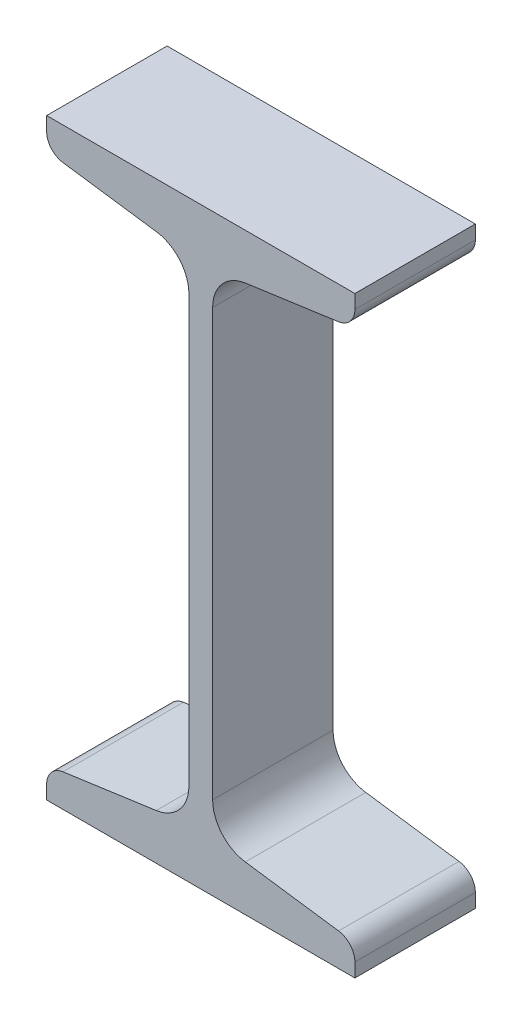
ISO-10303-21;
HEADER;
FILE_DESCRIPTION(('STEP AP214'),'2;1');
FILE_NAME('part.step','',(''),(''),'','','');
FILE_SCHEMA(('AUTOMOTIVE_DESIGN { 1 0 10303 214 1 1 1 1 }'));
ENDSEC;
DATA;
#1=APPLICATION_CONTEXT('core data for automotive mechanical design processes');
#2=APPLICATION_PROTOCOL_DEFINITION('international standard','automotive_design',2000,#1);
#3=PRODUCT_CONTEXT('',#1,'mechanical');
#4=PRODUCT('Part','Part','',(#3));
#5=PRODUCT_RELATED_PRODUCT_CATEGORY('part','',(#4));
#6=PRODUCT_DEFINITION_FORMATION('','',#4);
#7=PRODUCT_DEFINITION_CONTEXT('part definition',#1,'design');
#8=PRODUCT_DEFINITION('design','',#6,#7);
#9=PRODUCT_DEFINITION_SHAPE('','',#8);
#10=(LENGTH_UNIT() NAMED_UNIT(*) SI_UNIT(.MILLI.,.METRE.));
#11=(NAMED_UNIT(*) PLANE_ANGLE_UNIT() SI_UNIT($,.RADIAN.));
#12=(NAMED_UNIT(*) SI_UNIT($,.STERADIAN.) SOLID_ANGLE_UNIT());
#13=UNCERTAINTY_MEASURE_WITH_UNIT(LENGTH_MEASURE(1.E-05),#10,'distance_accuracy_value','');
#14=(GEOMETRIC_REPRESENTATION_CONTEXT(3) GLOBAL_UNCERTAINTY_ASSIGNED_CONTEXT((#13)) GLOBAL_UNIT_ASSIGNED_CONTEXT((#10,
#11,#12)) REPRESENTATION_CONTEXT('',''));
#15=CARTESIAN_POINT('',(0.,0.,0.));
#16=DIRECTION('',(0.,0.,1.));
#17=DIRECTION('',(1.,0.,0.));
#18=AXIS2_PLACEMENT_3D('',#15,#16,#17);
#19=CARTESIAN_POINT('',(-32.5,62.5,12.7));
#20=DIRECTION('',(1.,0.,0.));
#21=DIRECTION('',(0.,0.,-1.));
#22=AXIS2_PLACEMENT_3D('',#19,#20,#21);
#23=PLANE('',#22);
#24=DIRECTION('',(0.,-1.,0.));
#25=VECTOR('',#24,1.);
#26=CARTESIAN_POINT('',(-32.5,62.5,-12.7));
#27=LINE('',#26,#25);
#28=CARTESIAN_POINT('',(-32.5,62.5,-12.7));
#29=VERTEX_POINT('',#28);
#30=CARTESIAN_POINT('',(-32.5,59.5852594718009,-12.7));
#31=VERTEX_POINT('',#30);
#32=EDGE_CURVE('E201',#29,#31,#27,.T.);
#33=ORIENTED_EDGE('',*,*,#32,.T.);
#34=DIRECTION('',(0.,0.,-1.));
#35=VECTOR('',#34,1.);
#36=CARTESIAN_POINT('',(-32.5,59.5852594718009,12.7));
#37=LINE('',#36,#35);
#38=CARTESIAN_POINT('',(-32.5,59.5852594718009,12.7));
#39=VERTEX_POINT('',#38);
#40=EDGE_CURVE('E11',#39,#31,#37,.T.);
#41=ORIENTED_EDGE('',*,*,#40,.F.);
#42=DIRECTION('',(0.,-1.,0.));
#43=VECTOR('',#42,1.);
#44=CARTESIAN_POINT('',(-32.5,62.5,12.7));
#45=LINE('',#44,#43);
#46=CARTESIAN_POINT('',(-32.5,62.5,12.7));
#47=VERTEX_POINT('',#46);
#48=EDGE_CURVE('E239',#47,#39,#45,.T.);
#49=ORIENTED_EDGE('',*,*,#48,.F.);
#50=DIRECTION('',(0.,0.,-1.));
#51=VECTOR('',#50,1.);
#52=CARTESIAN_POINT('',(-32.5,62.5,12.7));
#53=LINE('',#52,#51);
#54=EDGE_CURVE('E197',#47,#29,#53,.T.);
#55=ORIENTED_EDGE('',*,*,#54,.T.);
#56=EDGE_LOOP('',(#33,#41,#49,#55));
#57=FACE_BOUND('',#56,.T.);
#58=ADVANCED_FACE('F33',(#57),#23,.F.);
#59=CARTESIAN_POINT('',(-28.5,59.5852594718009,12.7));
#60=DIRECTION('',(0.,0.,-1.));
#61=DIRECTION('',(-1.,0.,0.));
#62=AXIS2_PLACEMENT_3D('',#59,#60,#61);
#63=CYLINDRICAL_SURFACE('',#62,4.);
#64=CARTESIAN_POINT('',(-28.5,59.5852594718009,-12.7));
#65=DIRECTION('',(0.,0.,1.));
#66=DIRECTION('',(1.,0.,0.));
#67=AXIS2_PLACEMENT_3D('',#64,#65,#66);
#68=CIRCLE('',#67,4.);
#69=CARTESIAN_POINT('',(-29.0566924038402,55.6241871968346,-12.7));
#70=VERTEX_POINT('',#69);
#71=EDGE_CURVE('E204',#31,#70,#68,.T.);
#72=ORIENTED_EDGE('',*,*,#71,.T.);
#73=DIRECTION('',(0.,0.,-1.));
#74=VECTOR('',#73,1.);
#75=CARTESIAN_POINT('',(-29.0566924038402,55.6241871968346,12.7));
#76=LINE('',#75,#74);
#77=CARTESIAN_POINT('',(-29.0566924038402,55.6241871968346,12.7));
#78=VERTEX_POINT('',#77);
#79=EDGE_CURVE('E41',#78,#70,#76,.T.);
#80=ORIENTED_EDGE('',*,*,#79,.F.);
#81=CARTESIAN_POINT('',(-28.5,59.5852594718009,12.7));
#82=DIRECTION('',(0.,0.,1.));
#83=DIRECTION('',(1.,0.,0.));
#84=AXIS2_PLACEMENT_3D('',#81,#82,#83);
#85=CIRCLE('',#84,4.);
#86=EDGE_CURVE('E128',#39,#78,#85,.T.);
#87=ORIENTED_EDGE('',*,*,#86,.F.);
#88=ORIENTED_EDGE('',*,*,#40,.T.);
#89=EDGE_LOOP('',(#72,#80,#87,#88));
#90=FACE_BOUND('',#89,.T.);
#91=ADVANCED_FACE('F357',(#90),#63,.T.);
#92=CARTESIAN_POINT('',(-29.0566924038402,55.6241871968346,12.7));
#93=DIRECTION('',(0.13917310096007,0.99026806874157,0.));
#94=DIRECTION('',(-0.99026806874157,0.13917310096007,0.));
#95=AXIS2_PLACEMENT_3D('',#92,#93,#94);
#96=PLANE('',#95);
#97=DIRECTION('',(0.99026806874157,-0.13917310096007,0.));
#98=VECTOR('',#97,1.);
#99=CARTESIAN_POINT('',(-29.0566924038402,55.6241871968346,-12.7));
#100=LINE('',#99,#98);
#101=CARTESIAN_POINT('',(-9.38661519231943,52.8597381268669,-12.7));
#102=VERTEX_POINT('',#101);
#103=EDGE_CURVE('E206',#70,#102,#100,.T.);
#104=ORIENTED_EDGE('',*,*,#103,.T.);
#105=DIRECTION('',(0.,0.,-1.));
#106=VECTOR('',#105,1.);
#107=CARTESIAN_POINT('',(-9.38661519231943,52.8597381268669,12.7));
#108=LINE('',#107,#106);
#109=CARTESIAN_POINT('',(-9.38661519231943,52.8597381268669,12.7));
#110=VERTEX_POINT('',#109);
#111=EDGE_CURVE('E282',#110,#102,#108,.T.);
#112=ORIENTED_EDGE('',*,*,#111,.F.);
#113=DIRECTION('',(0.99026806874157,-0.13917310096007,0.));
#114=VECTOR('',#113,1.);
#115=CARTESIAN_POINT('',(-29.0566924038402,55.6241871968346,12.7));
#116=LINE('',#115,#114);
#117=EDGE_CURVE('E290',#78,#110,#116,.T.);
#118=ORIENTED_EDGE('',*,*,#117,.F.);
#119=ORIENTED_EDGE('',*,*,#79,.T.);
#120=EDGE_LOOP('',(#104,#112,#118,#119));
#121=FACE_BOUND('',#120,.T.);
#122=ADVANCED_FACE('F288',(#121),#96,.F.);
#123=CARTESIAN_POINT('',(-10.5,44.9375935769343,12.7));
#124=DIRECTION('',(0.,0.,-1.));
#125=DIRECTION('',(-1.,0.,0.));
#126=AXIS2_PLACEMENT_3D('',#123,#124,#125);
#127=CYLINDRICAL_SURFACE('',#126,7.99999999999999);
#128=CARTESIAN_POINT('',(-10.5,44.9375935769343,-12.7));
#129=DIRECTION('',(0.,0.,-1.));
#130=DIRECTION('',(-1.,0.,0.));
#131=AXIS2_PLACEMENT_3D('',#128,#129,#130);
#132=CIRCLE('',#131,7.99999999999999);
#133=CARTESIAN_POINT('',(-2.49999999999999,44.9375935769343,-12.7));
#134=VERTEX_POINT('',#133);
#135=EDGE_CURVE('E208',#102,#134,#132,.T.);
#136=ORIENTED_EDGE('',*,*,#135,.T.);
#137=DIRECTION('',(0.,0.,-1.));
#138=VECTOR('',#137,1.);
#139=CARTESIAN_POINT('',(-2.49999999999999,44.9375935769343,12.7));
#140=LINE('',#139,#138);
#141=CARTESIAN_POINT('',(-2.49999999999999,44.9375935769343,12.7));
#142=VERTEX_POINT('',#141);
#143=EDGE_CURVE('E279',#142,#134,#140,.T.);
#144=ORIENTED_EDGE('',*,*,#143,.F.);
#145=CARTESIAN_POINT('',(-10.5,44.9375935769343,12.7));
#146=DIRECTION('',(0.,0.,-1.));
#147=DIRECTION('',(-1.,0.,0.));
#148=AXIS2_PLACEMENT_3D('',#145,#146,#147);
#149=CIRCLE('',#148,7.99999999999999);
#150=EDGE_CURVE('E308',#110,#142,#149,.T.);
#151=ORIENTED_EDGE('',*,*,#150,.F.);
#152=ORIENTED_EDGE('',*,*,#111,.T.);
#153=EDGE_LOOP('',(#136,#144,#151,#152));
#154=FACE_BOUND('',#153,.T.);
#155=ADVANCED_FACE('F299',(#154),#127,.F.);
#156=CARTESIAN_POINT('',(-2.49999999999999,44.9375935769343,12.7));
#157=DIRECTION('',(1.,0.,0.));
#158=DIRECTION('',(0.,0.,-1.));
#159=AXIS2_PLACEMENT_3D('',#156,#157,#158);
#160=PLANE('',#159);
#161=DIRECTION('',(0.,-1.,0.));
#162=VECTOR('',#161,1.);
#163=CARTESIAN_POINT('',(-2.49999999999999,44.9375935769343,-12.7));
#164=LINE('',#163,#162);
#165=CARTESIAN_POINT('',(-2.49999999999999,-44.9375935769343,-12.7));
#166=VERTEX_POINT('',#165);
#167=EDGE_CURVE('E210',#134,#166,#164,.T.);
#168=ORIENTED_EDGE('',*,*,#167,.T.);
#169=DIRECTION('',(0.,0.,-1.));
#170=VECTOR('',#169,1.);
#171=CARTESIAN_POINT('',(-2.49999999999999,-44.9375935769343,12.7));
#172=LINE('',#171,#170);
#173=CARTESIAN_POINT('',(-2.49999999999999,-44.9375935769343,12.7));
#174=VERTEX_POINT('',#173);
#175=EDGE_CURVE('E276',#174,#166,#172,.T.);
#176=ORIENTED_EDGE('',*,*,#175,.F.);
#177=DIRECTION('',(0.,-1.,0.));
#178=VECTOR('',#177,1.);
#179=CARTESIAN_POINT('',(-2.49999999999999,44.9375935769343,12.7));
#180=LINE('',#179,#178);
#181=EDGE_CURVE('E305',#142,#174,#180,.T.);
#182=ORIENTED_EDGE('',*,*,#181,.F.);
#183=ORIENTED_EDGE('',*,*,#143,.T.);
#184=EDGE_LOOP('',(#168,#176,#182,#183));
#185=FACE_BOUND('',#184,.T.);
#186=ADVANCED_FACE('F303',(#185),#160,.F.);
#187=CARTESIAN_POINT('',(-10.5,-44.9375935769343,12.7));
#188=DIRECTION('',(0.,0.,-1.));
#189=DIRECTION('',(-1.,0.,0.));
#190=AXIS2_PLACEMENT_3D('',#187,#188,#189);
#191=CYLINDRICAL_SURFACE('',#190,7.99999999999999);
#192=CARTESIAN_POINT('',(-10.5,-44.9375935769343,-12.7));
#193=DIRECTION('',(0.,0.,-1.));
#194=DIRECTION('',(1.,0.,0.));
#195=AXIS2_PLACEMENT_3D('',#192,#193,#194);
#196=CIRCLE('',#195,7.99999999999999);
#197=CARTESIAN_POINT('',(-9.38661519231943,-52.8597381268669,-12.7));
#198=VERTEX_POINT('',#197);
#199=EDGE_CURVE('E212',#166,#198,#196,.T.);
#200=ORIENTED_EDGE('',*,*,#199,.T.);
#201=DIRECTION('',(0.,0.,-1.));
#202=VECTOR('',#201,1.);
#203=CARTESIAN_POINT('',(-9.38661519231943,-52.8597381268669,12.7));
#204=LINE('',#203,#202);
#205=CARTESIAN_POINT('',(-9.38661519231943,-52.8597381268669,12.7));
#206=VERTEX_POINT('',#205);
#207=EDGE_CURVE('E273',#206,#198,#204,.T.);
#208=ORIENTED_EDGE('',*,*,#207,.F.);
#209=CARTESIAN_POINT('',(-10.5,-44.9375935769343,12.7));
#210=DIRECTION('',(0.,0.,-1.));
#211=DIRECTION('',(1.,0.,0.));
#212=AXIS2_PLACEMENT_3D('',#209,#210,#211);
#213=CIRCLE('',#212,7.99999999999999);
#214=EDGE_CURVE('E307',#174,#206,#213,.T.);
#215=ORIENTED_EDGE('',*,*,#214,.F.);
#216=ORIENTED_EDGE('',*,*,#175,.T.);
#217=EDGE_LOOP('',(#200,#208,#215,#216));
#218=FACE_BOUND('',#217,.T.);
#219=ADVANCED_FACE('F370',(#218),#191,.F.);
#220=CARTESIAN_POINT('',(-29.0566924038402,-55.6241871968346,12.7));
#221=DIRECTION('',(0.13917310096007,-0.99026806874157,0.));
#222=DIRECTION('',(0.99026806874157,0.13917310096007,0.));
#223=AXIS2_PLACEMENT_3D('',#220,#221,#222);
#224=PLANE('',#223);
#225=DIRECTION('',(-0.99026806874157,-0.13917310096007,0.));
#226=VECTOR('',#225,1.);
#227=CARTESIAN_POINT('',(-29.0566924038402,-55.6241871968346,-12.7));
#228=LINE('',#227,#226);
#229=CARTESIAN_POINT('',(-29.0566924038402,-55.6241871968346,-12.7));
#230=VERTEX_POINT('',#229);
#231=EDGE_CURVE('E214',#198,#230,#228,.T.);
#232=ORIENTED_EDGE('',*,*,#231,.T.);
#233=DIRECTION('',(0.,0.,-1.));
#234=VECTOR('',#233,1.);
#235=CARTESIAN_POINT('',(-29.0566924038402,-55.6241871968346,12.7));
#236=LINE('',#235,#234);
#237=CARTESIAN_POINT('',(-29.0566924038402,-55.6241871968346,12.7));
#238=VERTEX_POINT('',#237);
#239=EDGE_CURVE('E270',#238,#230,#236,.T.);
#240=ORIENTED_EDGE('',*,*,#239,.F.);
#241=DIRECTION('',(-0.99026806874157,-0.13917310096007,0.));
#242=VECTOR('',#241,1.);
#243=CARTESIAN_POINT('',(-29.0566924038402,-55.6241871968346,12.7));
#244=LINE('',#243,#242);
#245=EDGE_CURVE('E310',#206,#238,#244,.T.);
#246=ORIENTED_EDGE('',*,*,#245,.F.);
#247=ORIENTED_EDGE('',*,*,#207,.T.);
#248=EDGE_LOOP('',(#232,#240,#246,#247));
#249=FACE_BOUND('',#248,.T.);
#250=ADVANCED_FACE('F373',(#249),#224,.F.);
#251=CARTESIAN_POINT('',(-28.5,-59.5852594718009,12.7));
#252=DIRECTION('',(0.,0.,-1.));
#253=DIRECTION('',(-1.,0.,0.));
#254=AXIS2_PLACEMENT_3D('',#251,#252,#253);
#255=CYLINDRICAL_SURFACE('',#254,4.);
#256=CARTESIAN_POINT('',(-28.5,-59.5852594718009,-12.7));
#257=DIRECTION('',(0.,0.,1.));
#258=DIRECTION('',(-1.,0.,0.));
#259=AXIS2_PLACEMENT_3D('',#256,#257,#258);
#260=CIRCLE('',#259,4.);
#261=CARTESIAN_POINT('',(-32.5,-59.5852594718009,-12.7));
#262=VERTEX_POINT('',#261);
#263=EDGE_CURVE('E216',#230,#262,#260,.T.);
#264=ORIENTED_EDGE('',*,*,#263,.T.);
#265=DIRECTION('',(0.,0.,-1.));
#266=VECTOR('',#265,1.);
#267=CARTESIAN_POINT('',(-32.5,-59.5852594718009,12.7));
#268=LINE('',#267,#266);
#269=CARTESIAN_POINT('',(-32.5,-59.5852594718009,12.7));
#270=VERTEX_POINT('',#269);
#271=EDGE_CURVE('E267',#270,#262,#268,.T.);
#272=ORIENTED_EDGE('',*,*,#271,.F.);
#273=CARTESIAN_POINT('',(-28.5,-59.5852594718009,12.7));
#274=DIRECTION('',(0.,0.,1.));
#275=DIRECTION('',(-1.,0.,0.));
#276=AXIS2_PLACEMENT_3D('',#273,#274,#275);
#277=CIRCLE('',#276,4.);
#278=EDGE_CURVE('E316',#238,#270,#277,.T.);
#279=ORIENTED_EDGE('',*,*,#278,.F.);
#280=ORIENTED_EDGE('',*,*,#239,.T.);
#281=EDGE_LOOP('',(#264,#272,#279,#280));
#282=FACE_BOUND('',#281,.T.);
#283=ADVANCED_FACE('F377',(#282),#255,.T.);
#284=CARTESIAN_POINT('',(-32.5,-59.5852594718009,12.7));
#285=DIRECTION('',(1.,0.,0.));
#286=DIRECTION('',(0.,0.,-1.));
#287=AXIS2_PLACEMENT_3D('',#284,#285,#286);
#288=PLANE('',#287);
#289=DIRECTION('',(0.,-1.,0.));
#290=VECTOR('',#289,1.);
#291=CARTESIAN_POINT('',(-32.5,-59.5852594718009,-12.7));
#292=LINE('',#291,#290);
#293=CARTESIAN_POINT('',(-32.5,-62.5,-12.7));
#294=VERTEX_POINT('',#293);
#295=EDGE_CURVE('E218',#262,#294,#292,.T.);
#296=ORIENTED_EDGE('',*,*,#295,.T.);
#297=DIRECTION('',(0.,0.,-1.));
#298=VECTOR('',#297,1.);
#299=CARTESIAN_POINT('',(-32.5,-62.5,12.7));
#300=LINE('',#299,#298);
#301=CARTESIAN_POINT('',(-32.5,-62.5,12.7));
#302=VERTEX_POINT('',#301);
#303=EDGE_CURVE('E264',#302,#294,#300,.T.);
#304=ORIENTED_EDGE('',*,*,#303,.F.);
#305=DIRECTION('',(0.,-1.,0.));
#306=VECTOR('',#305,1.);
#307=CARTESIAN_POINT('',(-32.5,-59.5852594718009,12.7));
#308=LINE('',#307,#306);
#309=EDGE_CURVE('E318',#270,#302,#308,.T.);
#310=ORIENTED_EDGE('',*,*,#309,.F.);
#311=ORIENTED_EDGE('',*,*,#271,.T.);
#312=EDGE_LOOP('',(#296,#304,#310,#311));
#313=FACE_BOUND('',#312,.T.);
#314=ADVANCED_FACE('F381',(#313),#288,.F.);
#315=CARTESIAN_POINT('',(-32.5,-62.5,12.7));
#316=DIRECTION('',(0.,1.,0.));
#317=DIRECTION('',(-1.,0.,0.));
#318=AXIS2_PLACEMENT_3D('',#315,#316,#317);
#319=PLANE('',#318);
#320=DIRECTION('',(1.,0.,0.));
#321=VECTOR('',#320,1.);
#322=CARTESIAN_POINT('',(-32.5,-62.5,-12.7));
#323=LINE('',#322,#321);
#324=CARTESIAN_POINT('',(32.5,-62.5,-12.7));
#325=VERTEX_POINT('',#324);
#326=EDGE_CURVE('E220',#294,#325,#323,.T.);
#327=ORIENTED_EDGE('',*,*,#326,.T.);
#328=DIRECTION('',(0.,0.,-1.));
#329=VECTOR('',#328,1.);
#330=CARTESIAN_POINT('',(32.5,-62.5,12.7));
#331=LINE('',#330,#329);
#332=CARTESIAN_POINT('',(32.5,-62.5,12.7));
#333=VERTEX_POINT('',#332);
#334=EDGE_CURVE('E261',#333,#325,#331,.T.);
#335=ORIENTED_EDGE('',*,*,#334,.F.);
#336=DIRECTION('',(1.,0.,0.));
#337=VECTOR('',#336,1.);
#338=CARTESIAN_POINT('',(-32.5,-62.5,12.7));
#339=LINE('',#338,#337);
#340=EDGE_CURVE('E320',#302,#333,#339,.T.);
#341=ORIENTED_EDGE('',*,*,#340,.F.);
#342=ORIENTED_EDGE('',*,*,#303,.T.);
#343=EDGE_LOOP('',(#327,#335,#341,#342));
#344=FACE_BOUND('',#343,.T.);
#345=ADVANCED_FACE('F385',(#344),#319,.F.);
#346=CARTESIAN_POINT('',(32.5,-59.5852594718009,12.7));
#347=DIRECTION('',(-1.,0.,0.));
#348=DIRECTION('',(0.,0.,1.));
#349=AXIS2_PLACEMENT_3D('',#346,#347,#348);
#350=PLANE('',#349);
#351=DIRECTION('',(0.,1.,0.));
#352=VECTOR('',#351,1.);
#353=CARTESIAN_POINT('',(32.5,-59.5852594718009,-12.7));
#354=LINE('',#353,#352);
#355=CARTESIAN_POINT('',(32.5,-59.5852594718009,-12.7));
#356=VERTEX_POINT('',#355);
#357=EDGE_CURVE('E222',#325,#356,#354,.T.);
#358=ORIENTED_EDGE('',*,*,#357,.T.);
#359=DIRECTION('',(0.,0.,-1.));
#360=VECTOR('',#359,1.);
#361=CARTESIAN_POINT('',(32.5,-59.5852594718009,12.7));
#362=LINE('',#361,#360);
#363=CARTESIAN_POINT('',(32.5,-59.5852594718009,12.7));
#364=VERTEX_POINT('',#363);
#365=EDGE_CURVE('E258',#364,#356,#362,.T.);
#366=ORIENTED_EDGE('',*,*,#365,.F.);
#367=DIRECTION('',(0.,1.,0.));
#368=VECTOR('',#367,1.);
#369=CARTESIAN_POINT('',(32.5,-59.5852594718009,12.7));
#370=LINE('',#369,#368);
#371=EDGE_CURVE('E322',#333,#364,#370,.T.);
#372=ORIENTED_EDGE('',*,*,#371,.F.);
#373=ORIENTED_EDGE('',*,*,#334,.T.);
#374=EDGE_LOOP('',(#358,#366,#372,#373));
#375=FACE_BOUND('',#374,.T.);
#376=ADVANCED_FACE('F389',(#375),#350,.F.);
#377=CARTESIAN_POINT('',(28.5,-59.5852594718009,12.7));
#378=DIRECTION('',(0.,0.,-1.));
#379=DIRECTION('',(-1.,0.,0.));
#380=AXIS2_PLACEMENT_3D('',#377,#378,#379);
#381=CYLINDRICAL_SURFACE('',#380,4.);
#382=CARTESIAN_POINT('',(28.5,-59.5852594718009,-12.7));
#383=DIRECTION('',(0.,0.,1.));
#384=DIRECTION('',(1.,0.,0.));
#385=AXIS2_PLACEMENT_3D('',#382,#383,#384);
#386=CIRCLE('',#385,4.);
#387=CARTESIAN_POINT('',(29.0566924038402,-55.6241871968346,-12.7));
#388=VERTEX_POINT('',#387);
#389=EDGE_CURVE('E224',#356,#388,#386,.T.);
#390=ORIENTED_EDGE('',*,*,#389,.T.);
#391=DIRECTION('',(0.,0.,-1.));
#392=VECTOR('',#391,1.);
#393=CARTESIAN_POINT('',(29.0566924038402,-55.6241871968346,12.7));
#394=LINE('',#393,#392);
#395=CARTESIAN_POINT('',(29.0566924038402,-55.6241871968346,12.7));
#396=VERTEX_POINT('',#395);
#397=EDGE_CURVE('E255',#396,#388,#394,.T.);
#398=ORIENTED_EDGE('',*,*,#397,.F.);
#399=CARTESIAN_POINT('',(28.5,-59.5852594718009,12.7));
#400=DIRECTION('',(0.,0.,1.));
#401=DIRECTION('',(1.,0.,0.));
#402=AXIS2_PLACEMENT_3D('',#399,#400,#401);
#403=CIRCLE('',#402,4.);
#404=EDGE_CURVE('E324',#364,#396,#403,.T.);
#405=ORIENTED_EDGE('',*,*,#404,.F.);
#406=ORIENTED_EDGE('',*,*,#365,.T.);
#407=EDGE_LOOP('',(#390,#398,#405,#406));
#408=FACE_BOUND('',#407,.T.);
#409=ADVANCED_FACE('F393',(#408),#381,.T.);
#410=CARTESIAN_POINT('',(29.0566924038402,-55.6241871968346,12.7));
#411=DIRECTION('',(-0.13917310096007,-0.99026806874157,0.));
#412=DIRECTION('',(0.99026806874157,-0.13917310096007,0.));
#413=AXIS2_PLACEMENT_3D('',#410,#411,#412);
#414=PLANE('',#413);
#415=DIRECTION('',(-0.99026806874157,0.13917310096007,0.));
#416=VECTOR('',#415,1.);
#417=CARTESIAN_POINT('',(29.0566924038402,-55.6241871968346,-12.7));
#418=LINE('',#417,#416);
#419=CARTESIAN_POINT('',(9.38661519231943,-52.8597381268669,-12.7));
#420=VERTEX_POINT('',#419);
#421=EDGE_CURVE('E226',#388,#420,#418,.T.);
#422=ORIENTED_EDGE('',*,*,#421,.T.);
#423=DIRECTION('',(0.,0.,-1.));
#424=VECTOR('',#423,1.);
#425=CARTESIAN_POINT('',(9.38661519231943,-52.8597381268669,12.7));
#426=LINE('',#425,#424);
#427=CARTESIAN_POINT('',(9.38661519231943,-52.8597381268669,12.7));
#428=VERTEX_POINT('',#427);
#429=EDGE_CURVE('E252',#428,#420,#426,.T.);
#430=ORIENTED_EDGE('',*,*,#429,.F.);
#431=DIRECTION('',(-0.99026806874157,0.13917310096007,0.));
#432=VECTOR('',#431,1.);
#433=CARTESIAN_POINT('',(29.0566924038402,-55.6241871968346,12.7));
#434=LINE('',#433,#432);
#435=EDGE_CURVE('E326',#396,#428,#434,.T.);
#436=ORIENTED_EDGE('',*,*,#435,.F.);
#437=ORIENTED_EDGE('',*,*,#397,.T.);
#438=EDGE_LOOP('',(#422,#430,#436,#437));
#439=FACE_BOUND('',#438,.T.);
#440=ADVANCED_FACE('F397',(#439),#414,.F.);
#441=CARTESIAN_POINT('',(10.5,-44.9375935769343,12.7));
#442=DIRECTION('',(0.,0.,-1.));
#443=DIRECTION('',(-1.,0.,0.));
#444=AXIS2_PLACEMENT_3D('',#441,#442,#443);
#445=CYLINDRICAL_SURFACE('',#444,7.99999999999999);
#446=CARTESIAN_POINT('',(10.5,-44.9375935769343,-12.7));
#447=DIRECTION('',(0.,0.,-1.));
#448=DIRECTION('',(-1.,0.,0.));
#449=AXIS2_PLACEMENT_3D('',#446,#447,#448);
#450=CIRCLE('',#449,7.99999999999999);
#451=CARTESIAN_POINT('',(2.49999999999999,-44.9375935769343,-12.7));
#452=VERTEX_POINT('',#451);
#453=EDGE_CURVE('E228',#420,#452,#450,.T.);
#454=ORIENTED_EDGE('',*,*,#453,.T.);
#455=DIRECTION('',(0.,0.,-1.));
#456=VECTOR('',#455,1.);
#457=CARTESIAN_POINT('',(2.49999999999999,-44.9375935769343,12.7));
#458=LINE('',#457,#456);
#459=CARTESIAN_POINT('',(2.49999999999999,-44.9375935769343,12.7));
#460=VERTEX_POINT('',#459);
#461=EDGE_CURVE('E249',#460,#452,#458,.T.);
#462=ORIENTED_EDGE('',*,*,#461,.F.);
#463=CARTESIAN_POINT('',(10.5,-44.9375935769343,12.7));
#464=DIRECTION('',(0.,0.,-1.));
#465=DIRECTION('',(-1.,0.,0.));
#466=AXIS2_PLACEMENT_3D('',#463,#464,#465);
#467=CIRCLE('',#466,7.99999999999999);
#468=EDGE_CURVE('E328',#428,#460,#467,.T.);
#469=ORIENTED_EDGE('',*,*,#468,.F.);
#470=ORIENTED_EDGE('',*,*,#429,.T.);
#471=EDGE_LOOP('',(#454,#462,#469,#470));
#472=FACE_BOUND('',#471,.T.);
#473=ADVANCED_FACE('F401',(#472),#445,.F.);
#474=CARTESIAN_POINT('',(2.49999999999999,44.9375935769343,12.7));
#475=DIRECTION('',(-1.,0.,0.));
#476=DIRECTION('',(0.,0.,1.));
#477=AXIS2_PLACEMENT_3D('',#474,#475,#476);
#478=PLANE('',#477);
#479=DIRECTION('',(0.,1.,0.));
#480=VECTOR('',#479,1.);
#481=CARTESIAN_POINT('',(2.49999999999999,44.9375935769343,-12.7));
#482=LINE('',#481,#480);
#483=CARTESIAN_POINT('',(2.5,44.9375935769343,-12.7));
#484=VERTEX_POINT('',#483);
#485=EDGE_CURVE('E230',#452,#484,#482,.T.);
#486=ORIENTED_EDGE('',*,*,#485,.T.);
#487=DIRECTION('',(0.,0.,-1.));
#488=VECTOR('',#487,1.);
#489=CARTESIAN_POINT('',(2.5,44.9375935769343,12.7));
#490=LINE('',#489,#488);
#491=CARTESIAN_POINT('',(2.5,44.9375935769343,12.7));
#492=VERTEX_POINT('',#491);
#493=EDGE_CURVE('E246',#492,#484,#490,.T.);
#494=ORIENTED_EDGE('',*,*,#493,.F.);
#495=DIRECTION('',(0.,1.,0.));
#496=VECTOR('',#495,1.);
#497=CARTESIAN_POINT('',(2.49999999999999,44.9375935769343,12.7));
#498=LINE('',#497,#496);
#499=EDGE_CURVE('E330',#460,#492,#498,.T.);
#500=ORIENTED_EDGE('',*,*,#499,.F.);
#501=ORIENTED_EDGE('',*,*,#461,.T.);
#502=EDGE_LOOP('',(#486,#494,#500,#501));
#503=FACE_BOUND('',#502,.T.);
#504=ADVANCED_FACE('F405',(#503),#478,.F.);
#505=CARTESIAN_POINT('',(10.5,44.9375935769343,12.7));
#506=DIRECTION('',(0.,0.,-1.));
#507=DIRECTION('',(-1.,0.,0.));
#508=AXIS2_PLACEMENT_3D('',#505,#506,#507);
#509=CYLINDRICAL_SURFACE('',#508,7.99999999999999);
#510=CARTESIAN_POINT('',(10.5,44.9375935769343,-12.7));
#511=DIRECTION('',(0.,0.,-1.));
#512=DIRECTION('',(1.,0.,0.));
#513=AXIS2_PLACEMENT_3D('',#510,#511,#512);
#514=CIRCLE('',#513,7.99999999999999);
#515=CARTESIAN_POINT('',(9.38661519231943,52.8597381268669,-12.7));
#516=VERTEX_POINT('',#515);
#517=EDGE_CURVE('E232',#484,#516,#514,.T.);
#518=ORIENTED_EDGE('',*,*,#517,.T.);
#519=DIRECTION('',(0.,0.,-1.));
#520=VECTOR('',#519,1.);
#521=CARTESIAN_POINT('',(9.38661519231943,52.8597381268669,12.7));
#522=LINE('',#521,#520);
#523=CARTESIAN_POINT('',(9.38661519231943,52.8597381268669,12.7));
#524=VERTEX_POINT('',#523);
#525=EDGE_CURVE('E243',#524,#516,#522,.T.);
#526=ORIENTED_EDGE('',*,*,#525,.F.);
#527=CARTESIAN_POINT('',(10.5,44.9375935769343,12.7));
#528=DIRECTION('',(0.,0.,-1.));
#529=DIRECTION('',(1.,0.,0.));
#530=AXIS2_PLACEMENT_3D('',#527,#528,#529);
#531=CIRCLE('',#530,7.99999999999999);
#532=EDGE_CURVE('E332',#492,#524,#531,.T.);
#533=ORIENTED_EDGE('',*,*,#532,.F.);
#534=ORIENTED_EDGE('',*,*,#493,.T.);
#535=EDGE_LOOP('',(#518,#526,#533,#534));
#536=FACE_BOUND('',#535,.T.);
#537=ADVANCED_FACE('F338',(#536),#509,.F.);
#538=CARTESIAN_POINT('',(29.0566924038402,55.6241871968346,12.7));
#539=DIRECTION('',(-0.13917310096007,0.99026806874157,0.));
#540=DIRECTION('',(-0.99026806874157,-0.13917310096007,0.));
#541=AXIS2_PLACEMENT_3D('',#538,#539,#540);
#542=PLANE('',#541);
#543=DIRECTION('',(0.99026806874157,0.13917310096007,0.));
#544=VECTOR('',#543,1.);
#545=CARTESIAN_POINT('',(29.0566924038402,55.6241871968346,-12.7));
#546=LINE('',#545,#544);
#547=CARTESIAN_POINT('',(29.0566924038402,55.6241871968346,-12.7));
#548=VERTEX_POINT('',#547);
#549=EDGE_CURVE('E234',#516,#548,#546,.T.);
#550=ORIENTED_EDGE('',*,*,#549,.T.);
#551=DIRECTION('',(0.,0.,-1.));
#552=VECTOR('',#551,1.);
#553=CARTESIAN_POINT('',(29.0566924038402,55.6241871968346,12.7));
#554=LINE('',#553,#552);
#555=CARTESIAN_POINT('',(29.0566924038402,55.6241871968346,12.7));
#556=VERTEX_POINT('',#555);
#557=EDGE_CURVE('E192',#556,#548,#554,.T.);
#558=ORIENTED_EDGE('',*,*,#557,.F.);
#559=DIRECTION('',(0.99026806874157,0.13917310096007,0.));
#560=VECTOR('',#559,1.);
#561=CARTESIAN_POINT('',(29.0566924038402,55.6241871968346,12.7));
#562=LINE('',#561,#560);
#563=EDGE_CURVE('E183',#524,#556,#562,.T.);
#564=ORIENTED_EDGE('',*,*,#563,.F.);
#565=ORIENTED_EDGE('',*,*,#525,.T.);
#566=EDGE_LOOP('',(#550,#558,#564,#565));
#567=FACE_BOUND('',#566,.T.);
#568=ADVANCED_FACE('F342',(#567),#542,.F.);
#569=CARTESIAN_POINT('',(28.5,59.5852594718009,12.7));
#570=DIRECTION('',(0.,0.,-1.));
#571=DIRECTION('',(-1.,0.,0.));
#572=AXIS2_PLACEMENT_3D('',#569,#570,#571);
#573=CYLINDRICAL_SURFACE('',#572,4.);
#574=CARTESIAN_POINT('',(28.5,59.5852594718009,-12.7));
#575=DIRECTION('',(0.,0.,1.));
#576=DIRECTION('',(1.,0.,0.));
#577=AXIS2_PLACEMENT_3D('',#574,#575,#576);
#578=CIRCLE('',#577,4.);
#579=CARTESIAN_POINT('',(32.5,59.5852594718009,-12.7));
#580=VERTEX_POINT('',#579);
#581=EDGE_CURVE('E191',#548,#580,#578,.T.);
#582=ORIENTED_EDGE('',*,*,#581,.T.);
#583=DIRECTION('',(0.,0.,-1.));
#584=VECTOR('',#583,1.);
#585=CARTESIAN_POINT('',(32.5,59.5852594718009,12.7));
#586=LINE('',#585,#584);
#587=CARTESIAN_POINT('',(32.5,59.5852594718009,12.7));
#588=VERTEX_POINT('',#587);
#589=EDGE_CURVE('E188',#588,#580,#586,.T.);
#590=ORIENTED_EDGE('',*,*,#589,.F.);
#591=CARTESIAN_POINT('',(28.5,59.5852594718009,12.7));
#592=DIRECTION('',(0.,0.,1.));
#593=DIRECTION('',(1.,0.,0.));
#594=AXIS2_PLACEMENT_3D('',#591,#592,#593);
#595=CIRCLE('',#594,4.);
#596=EDGE_CURVE('E177',#556,#588,#595,.T.);
#597=ORIENTED_EDGE('',*,*,#596,.F.);
#598=ORIENTED_EDGE('',*,*,#557,.T.);
#599=EDGE_LOOP('',(#582,#590,#597,#598));
#600=FACE_BOUND('',#599,.T.);
#601=ADVANCED_FACE('F189',(#600),#573,.T.);
#602=CARTESIAN_POINT('',(32.5,62.5,12.7));
#603=DIRECTION('',(-1.,0.,0.));
#604=DIRECTION('',(0.,0.,1.));
#605=AXIS2_PLACEMENT_3D('',#602,#603,#604);
#606=PLANE('',#605);
#607=DIRECTION('',(0.,1.,0.));
#608=VECTOR('',#607,1.);
#609=CARTESIAN_POINT('',(32.5,62.5,-12.7));
#610=LINE('',#609,#608);
#611=CARTESIAN_POINT('',(32.5,62.5,-12.7));
#612=VERTEX_POINT('',#611);
#613=EDGE_CURVE('E114',#580,#612,#610,.T.);
#614=ORIENTED_EDGE('',*,*,#613,.T.);
#615=DIRECTION('',(0.,0.,-1.));
#616=VECTOR('',#615,1.);
#617=CARTESIAN_POINT('',(32.5,62.5,12.7));
#618=LINE('',#617,#616);
#619=CARTESIAN_POINT('',(32.5,62.5,12.7));
#620=VERTEX_POINT('',#619);
#621=EDGE_CURVE('E193',#620,#612,#618,.T.);
#622=ORIENTED_EDGE('',*,*,#621,.F.);
#623=DIRECTION('',(0.,1.,0.));
#624=VECTOR('',#623,1.);
#625=CARTESIAN_POINT('',(32.5,62.5,12.7));
#626=LINE('',#625,#624);
#627=EDGE_CURVE('E181',#588,#620,#626,.T.);
#628=ORIENTED_EDGE('',*,*,#627,.F.);
#629=ORIENTED_EDGE('',*,*,#589,.T.);
#630=EDGE_LOOP('',(#614,#622,#628,#629));
#631=FACE_BOUND('',#630,.T.);
#632=ADVANCED_FACE('F195',(#631),#606,.F.);
#633=CARTESIAN_POINT('',(-32.5,62.5,12.7));
#634=DIRECTION('',(0.,-1.,0.));
#635=DIRECTION('',(1.,0.,0.));
#636=AXIS2_PLACEMENT_3D('',#633,#634,#635);
#637=PLANE('',#636);
#638=DIRECTION('',(-1.,0.,0.));
#639=VECTOR('',#638,1.);
#640=CARTESIAN_POINT('',(-32.5,62.5,-12.7));
#641=LINE('',#640,#639);
#642=EDGE_CURVE('E120',#612,#29,#641,.T.);
#643=ORIENTED_EDGE('',*,*,#642,.T.);
#644=ORIENTED_EDGE('',*,*,#54,.F.);
#645=DIRECTION('',(-1.,0.,0.));
#646=VECTOR('',#645,1.);
#647=CARTESIAN_POINT('',(-32.5,62.5,12.7));
#648=LINE('',#647,#646);
#649=EDGE_CURVE('E49',#620,#47,#648,.T.);
#650=ORIENTED_EDGE('',*,*,#649,.F.);
#651=ORIENTED_EDGE('',*,*,#621,.T.);
#652=EDGE_LOOP('',(#643,#644,#650,#651));
#653=FACE_BOUND('',#652,.T.);
#654=ADVANCED_FACE('F346',(#653),#637,.F.);
#655=CARTESIAN_POINT('',(-28.5,59.5852594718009,12.7));
#656=DIRECTION('',(0.,0.,1.));
#657=DIRECTION('',(1.,0.,0.));
#658=AXIS2_PLACEMENT_3D('',#655,#656,#657);
#659=PLANE('',#658);
#660=ORIENTED_EDGE('',*,*,#48,.T.);
#661=ORIENTED_EDGE('',*,*,#86,.T.);
#662=ORIENTED_EDGE('',*,*,#117,.T.);
#663=ORIENTED_EDGE('',*,*,#150,.T.);
#664=ORIENTED_EDGE('',*,*,#181,.T.);
#665=ORIENTED_EDGE('',*,*,#214,.T.);
#666=ORIENTED_EDGE('',*,*,#245,.T.);
#667=ORIENTED_EDGE('',*,*,#278,.T.);
#668=ORIENTED_EDGE('',*,*,#309,.T.);
#669=ORIENTED_EDGE('',*,*,#340,.T.);
#670=ORIENTED_EDGE('',*,*,#371,.T.);
#671=ORIENTED_EDGE('',*,*,#404,.T.);
#672=ORIENTED_EDGE('',*,*,#435,.T.);
#673=ORIENTED_EDGE('',*,*,#468,.T.);
#674=ORIENTED_EDGE('',*,*,#499,.T.);
#675=ORIENTED_EDGE('',*,*,#532,.T.);
#676=ORIENTED_EDGE('',*,*,#563,.T.);
#677=ORIENTED_EDGE('',*,*,#596,.T.);
#678=ORIENTED_EDGE('',*,*,#627,.T.);
#679=ORIENTED_EDGE('',*,*,#649,.T.);
#680=EDGE_LOOP('',(#660,#661,#662,#663,#664,#665,#666,#667,#668,#669,#670,#671,#672,#673,#674,
#675,#676,#677,#678,#679));
#681=FACE_BOUND('',#680,.T.);
#682=ADVANCED_FACE('F179',(#681),#659,.T.);
#683=CARTESIAN_POINT('',(-28.5,59.5852594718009,-12.7));
#684=DIRECTION('',(0.,0.,1.));
#685=DIRECTION('',(1.,0.,0.));
#686=AXIS2_PLACEMENT_3D('',#683,#684,#685);
#687=PLANE('',#686);
#688=ORIENTED_EDGE('',*,*,#32,.F.);
#689=ORIENTED_EDGE('',*,*,#642,.F.);
#690=ORIENTED_EDGE('',*,*,#613,.F.);
#691=ORIENTED_EDGE('',*,*,#581,.F.);
#692=ORIENTED_EDGE('',*,*,#549,.F.);
#693=ORIENTED_EDGE('',*,*,#517,.F.);
#694=ORIENTED_EDGE('',*,*,#485,.F.);
#695=ORIENTED_EDGE('',*,*,#453,.F.);
#696=ORIENTED_EDGE('',*,*,#421,.F.);
#697=ORIENTED_EDGE('',*,*,#389,.F.);
#698=ORIENTED_EDGE('',*,*,#357,.F.);
#699=ORIENTED_EDGE('',*,*,#326,.F.);
#700=ORIENTED_EDGE('',*,*,#295,.F.);
#701=ORIENTED_EDGE('',*,*,#263,.F.);
#702=ORIENTED_EDGE('',*,*,#231,.F.);
#703=ORIENTED_EDGE('',*,*,#199,.F.);
#704=ORIENTED_EDGE('',*,*,#167,.F.);
#705=ORIENTED_EDGE('',*,*,#135,.F.);
#706=ORIENTED_EDGE('',*,*,#103,.F.);
#707=ORIENTED_EDGE('',*,*,#71,.F.);
#708=EDGE_LOOP('',(#688,#689,#690,#691,#692,#693,#694,#695,#696,#697,#698,#699,#700,#701,#702,
#703,#704,#705,#706,#707));
#709=FACE_BOUND('',#708,.T.);
#710=ADVANCED_FACE('F294',(#709),#687,.F.);
#711=CLOSED_SHELL('',(#58,#91,#122,#155,#186,#219,#250,#283,#314,#345,#376,#409,#440,#473,#504,
#537,#568,#601,#632,#654,#682,#710));
#712=MANIFOLD_SOLID_BREP('B2',#711);
#713=ADVANCED_BREP_SHAPE_REPRESENTATION('',(#18,#712),#14);
#714=SHAPE_DEFINITION_REPRESENTATION(#9,#713);
ENDSEC;
END-ISO-10303-21;
